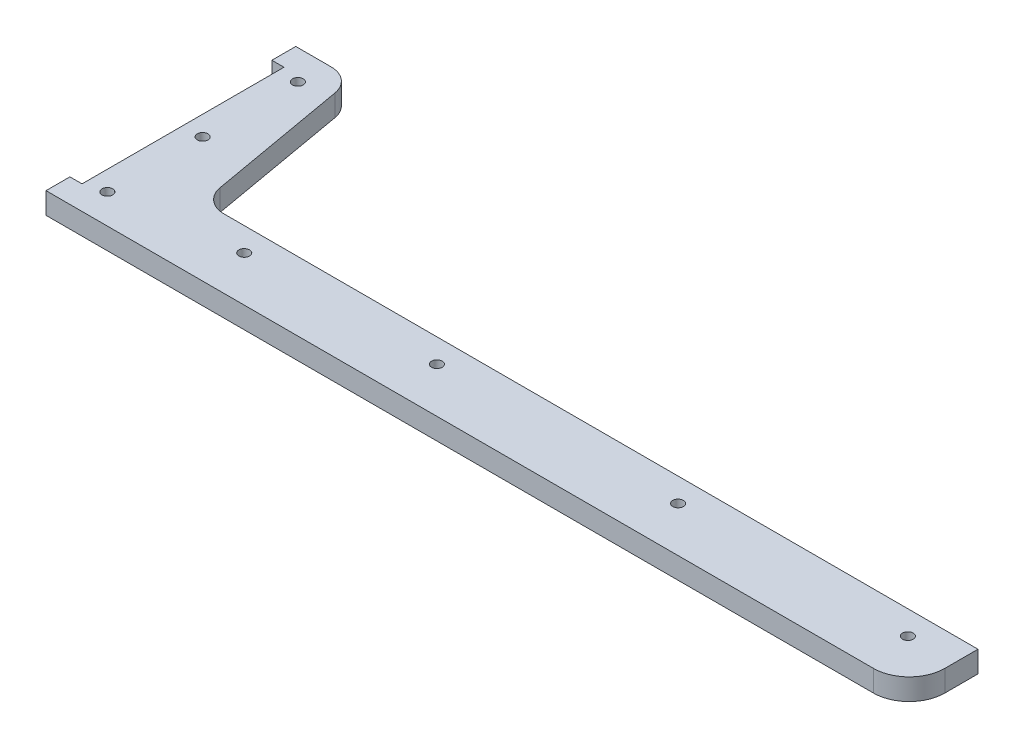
ISO-10303-21;
HEADER;
FILE_DESCRIPTION(('STEP AP214'),'2;1');
FILE_NAME('part.step','',(''),(''),'','','');
FILE_SCHEMA(('AUTOMOTIVE_DESIGN { 1 0 10303 214 1 1 1 1 }'));
ENDSEC;
DATA;
#1=APPLICATION_CONTEXT('core data for automotive mechanical design processes');
#2=APPLICATION_PROTOCOL_DEFINITION('international standard','automotive_design',2000,#1);
#3=PRODUCT_CONTEXT('',#1,'mechanical');
#4=PRODUCT('Part','Part','',(#3));
#5=PRODUCT_RELATED_PRODUCT_CATEGORY('part','',(#4));
#6=PRODUCT_DEFINITION_FORMATION('','',#4);
#7=PRODUCT_DEFINITION_CONTEXT('part definition',#1,'design');
#8=PRODUCT_DEFINITION('design','',#6,#7);
#9=PRODUCT_DEFINITION_SHAPE('','',#8);
#10=(LENGTH_UNIT() NAMED_UNIT(*) SI_UNIT(.MILLI.,.METRE.));
#11=(NAMED_UNIT(*) PLANE_ANGLE_UNIT() SI_UNIT($,.RADIAN.));
#12=(NAMED_UNIT(*) SI_UNIT($,.STERADIAN.) SOLID_ANGLE_UNIT());
#13=UNCERTAINTY_MEASURE_WITH_UNIT(LENGTH_MEASURE(1.E-05),#10,'distance_accuracy_value','');
#14=(GEOMETRIC_REPRESENTATION_CONTEXT(3) GLOBAL_UNCERTAINTY_ASSIGNED_CONTEXT((#13)) GLOBAL_UNIT_ASSIGNED_CONTEXT((#10,
#11,#12)) REPRESENTATION_CONTEXT('',''));
#15=CARTESIAN_POINT('',(0.,0.,0.));
#16=DIRECTION('',(0.,0.,1.));
#17=DIRECTION('',(1.,0.,0.));
#18=AXIS2_PLACEMENT_3D('',#15,#16,#17);
#19=CARTESIAN_POINT('',(0.,3.,0.));
#20=DIRECTION('',(0.,1.,0.));
#21=DIRECTION('',(0.,0.,1.));
#22=AXIS2_PLACEMENT_3D('',#19,#20,#21);
#23=PLANE('',#22);
#24=CARTESIAN_POINT('',(16.,3.,11.));
#25=DIRECTION('',(0.,1.,0.));
#26=DIRECTION('',(0.,0.,1.));
#27=AXIS2_PLACEMENT_3D('',#24,#25,#26);
#28=CIRCLE('',#27,1.5);
#29=CARTESIAN_POINT('',(16.,3.,12.5));
#30=VERTEX_POINT('',#29);
#31=EDGE_CURVE('E251',#30,#30,#28,.F.);
#32=ORIENTED_EDGE('',*,*,#31,.T.);
#33=EDGE_LOOP('',(#32));
#34=FACE_BOUND('',#33,.T.);
#35=CARTESIAN_POINT('',(16.,3.,-15.7));
#36=DIRECTION('',(0.,1.,0.));
#37=DIRECTION('',(0.,0.,1.));
#38=AXIS2_PLACEMENT_3D('',#35,#36,#37);
#39=CIRCLE('',#38,1.5);
#40=CARTESIAN_POINT('',(16.,3.,-14.2));
#41=VERTEX_POINT('',#40);
#42=EDGE_CURVE('E255',#41,#41,#39,.F.);
#43=ORIENTED_EDGE('',*,*,#42,.T.);
#44=EDGE_LOOP('',(#43));
#45=FACE_BOUND('',#44,.T.);
#46=CARTESIAN_POINT('',(16.,3.,-42.4));
#47=DIRECTION('',(0.,1.,0.));
#48=DIRECTION('',(0.,0.,1.));
#49=AXIS2_PLACEMENT_3D('',#46,#47,#48);
#50=CIRCLE('',#49,1.5);
#51=CARTESIAN_POINT('',(16.,3.,-40.9));
#52=VERTEX_POINT('',#51);
#53=EDGE_CURVE('E259',#52,#52,#50,.F.);
#54=ORIENTED_EDGE('',*,*,#53,.T.);
#55=EDGE_LOOP('',(#54));
#56=FACE_BOUND('',#55,.T.);
#57=CARTESIAN_POINT('',(50.,3.,6.65));
#58=DIRECTION('',(0.,1.,0.));
#59=DIRECTION('',(0.,0.,1.));
#60=AXIS2_PLACEMENT_3D('',#57,#58,#59);
#61=CIRCLE('',#60,1.5);
#62=CARTESIAN_POINT('',(50.,3.,8.15));
#63=VERTEX_POINT('',#62);
#64=EDGE_CURVE('E263',#63,#63,#61,.F.);
#65=ORIENTED_EDGE('',*,*,#64,.T.);
#66=EDGE_LOOP('',(#65));
#67=FACE_BOUND('',#66,.T.);
#68=CARTESIAN_POINT('',(104.,3.,6.65));
#69=DIRECTION('',(0.,1.,0.));
#70=DIRECTION('',(0.,0.,1.));
#71=AXIS2_PLACEMENT_3D('',#68,#69,#70);
#72=CIRCLE('',#71,1.5);
#73=CARTESIAN_POINT('',(104.,3.,8.15));
#74=VERTEX_POINT('',#73);
#75=EDGE_CURVE('E267',#74,#74,#72,.F.);
#76=ORIENTED_EDGE('',*,*,#75,.T.);
#77=EDGE_LOOP('',(#76));
#78=FACE_BOUND('',#77,.T.);
#79=CARTESIAN_POINT('',(171.6,3.,6.65));
#80=DIRECTION('',(0.,1.,0.));
#81=DIRECTION('',(0.,0.,1.));
#82=AXIS2_PLACEMENT_3D('',#79,#80,#81);
#83=CIRCLE('',#82,1.5);
#84=CARTESIAN_POINT('',(171.6,3.,8.15));
#85=VERTEX_POINT('',#84);
#86=EDGE_CURVE('E271',#85,#85,#83,.F.);
#87=ORIENTED_EDGE('',*,*,#86,.T.);
#88=EDGE_LOOP('',(#87));
#89=FACE_BOUND('',#88,.T.);
#90=CARTESIAN_POINT('',(236.,3.,6.65));
#91=DIRECTION('',(0.,1.,0.));
#92=DIRECTION('',(0.,0.,1.));
#93=AXIS2_PLACEMENT_3D('',#90,#91,#92);
#94=CIRCLE('',#93,1.5);
#95=CARTESIAN_POINT('',(236.,3.,8.15));
#96=VERTEX_POINT('',#95);
#97=EDGE_CURVE('E160',#96,#96,#94,.F.);
#98=ORIENTED_EDGE('',*,*,#97,.T.);
#99=EDGE_LOOP('',(#98));
#100=FACE_BOUND('',#99,.T.);
#101=DIRECTION('',(-1.,0.,0.));
#102=VECTOR('',#101,1.);
#103=CARTESIAN_POINT('',(249.,3.,0.));
#104=LINE('',#103,#102);
#105=CARTESIAN_POINT('',(37.67369741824,3.,0.));
#106=VERTEX_POINT('',#105);
#107=CARTESIAN_POINT('',(249.,3.,0.));
#108=VERTEX_POINT('',#107);
#109=EDGE_CURVE('E147',#106,#108,#104,.F.);
#110=ORIENTED_EDGE('',*,*,#109,.F.);
#111=CARTESIAN_POINT('',(37.67369741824,3.,-7.));
#112=DIRECTION('',(0.,1.,0.));
#113=DIRECTION('',(0.,0.,1.));
#114=AXIS2_PLACEMENT_3D('',#111,#112,#113);
#115=CIRCLE('',#114,7.);
#116=CARTESIAN_POINT('',(30.7800431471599,3.,-5.7844627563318));
#117=VERTEX_POINT('',#116);
#118=EDGE_CURVE('E20',#106,#117,#115,.F.);
#119=ORIENTED_EDGE('',*,*,#118,.T.);
#120=DIRECTION('',(-0.173648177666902,0.,-0.984807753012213));
#121=VECTOR('',#120,1.);
#122=CARTESIAN_POINT('',(30.78004314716,3.,-5.784462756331));
#123=LINE('',#122,#121);
#124=CARTESIAN_POINT('',(23.880178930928,3.,-44.9155372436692));
#125=VERTEX_POINT('',#124);
#126=EDGE_CURVE('E145',#125,#117,#123,.F.);
#127=ORIENTED_EDGE('',*,*,#126,.F.);
#128=CARTESIAN_POINT('',(16.98652465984,3.,-43.7));
#129=DIRECTION('',(0.,1.,0.));
#130=DIRECTION('',(0.,0.,1.));
#131=AXIS2_PLACEMENT_3D('',#128,#129,#130);
#132=CIRCLE('',#131,7.);
#133=CARTESIAN_POINT('',(16.98652465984,3.,-50.7));
#134=VERTEX_POINT('',#133);
#135=EDGE_CURVE('E281',#134,#125,#132,.F.);
#136=ORIENTED_EDGE('',*,*,#135,.F.);
#137=DIRECTION('',(-1.,0.,0.));
#138=VECTOR('',#137,1.);
#139=CARTESIAN_POINT('',(16.98652465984,3.,-50.7));
#140=LINE('',#139,#138);
#141=CARTESIAN_POINT('',(7.1,3.,-50.7));
#142=VERTEX_POINT('',#141);
#143=EDGE_CURVE('E205',#142,#134,#140,.F.);
#144=ORIENTED_EDGE('',*,*,#143,.F.);
#145=DIRECTION('',(0.,0.,1.));
#146=VECTOR('',#145,1.);
#147=CARTESIAN_POINT('',(7.1,3.,-50.7));
#148=LINE('',#147,#146);
#149=CARTESIAN_POINT('',(7.1,3.,-44.));
#150=VERTEX_POINT('',#149);
#151=EDGE_CURVE('E199',#150,#142,#148,.F.);
#152=ORIENTED_EDGE('',*,*,#151,.F.);
#153=DIRECTION('',(1.,0.,0.));
#154=VECTOR('',#153,1.);
#155=CARTESIAN_POINT('',(7.1,3.,-44.));
#156=LINE('',#155,#154);
#157=CARTESIAN_POINT('',(10.5,3.,-44.));
#158=VERTEX_POINT('',#157);
#159=EDGE_CURVE('E193',#158,#150,#156,.F.);
#160=ORIENTED_EDGE('',*,*,#159,.F.);
#161=DIRECTION('',(0.,0.,1.));
#162=VECTOR('',#161,1.);
#163=CARTESIAN_POINT('',(10.5,3.,-44.));
#164=LINE('',#163,#162);
#165=CARTESIAN_POINT('',(10.5,3.,12.6));
#166=VERTEX_POINT('',#165);
#167=EDGE_CURVE('E187',#166,#158,#164,.F.);
#168=ORIENTED_EDGE('',*,*,#167,.F.);
#169=DIRECTION('',(-1.,0.,0.));
#170=VECTOR('',#169,1.);
#171=CARTESIAN_POINT('',(10.5,3.,12.6));
#172=LINE('',#171,#170);
#173=CARTESIAN_POINT('',(7.1,3.,12.6));
#174=VERTEX_POINT('',#173);
#175=EDGE_CURVE('E181',#174,#166,#172,.F.);
#176=ORIENTED_EDGE('',*,*,#175,.F.);
#177=DIRECTION('',(0.,0.,1.));
#178=VECTOR('',#177,1.);
#179=CARTESIAN_POINT('',(7.1,3.,12.6));
#180=LINE('',#179,#178);
#181=CARTESIAN_POINT('',(7.1,3.,19.3));
#182=VERTEX_POINT('',#181);
#183=EDGE_CURVE('E175',#182,#174,#180,.F.);
#184=ORIENTED_EDGE('',*,*,#183,.F.);
#185=DIRECTION('',(1.,0.,0.));
#186=VECTOR('',#185,1.);
#187=CARTESIAN_POINT('',(7.1,3.,19.3));
#188=LINE('',#187,#186);
#189=CARTESIAN_POINT('',(239.,3.,19.3));
#190=VERTEX_POINT('',#189);
#191=EDGE_CURVE('E168',#190,#182,#188,.F.);
#192=ORIENTED_EDGE('',*,*,#191,.F.);
#193=CARTESIAN_POINT('',(239.,3.,9.3));
#194=DIRECTION('',(0.,1.,0.));
#195=DIRECTION('',(0.,0.,1.));
#196=AXIS2_PLACEMENT_3D('',#193,#194,#195);
#197=CIRCLE('',#196,10.);
#198=CARTESIAN_POINT('',(249.,3.,9.3));
#199=VERTEX_POINT('',#198);
#200=EDGE_CURVE('E278',#199,#190,#197,.F.);
#201=ORIENTED_EDGE('',*,*,#200,.F.);
#202=DIRECTION('',(0.,0.,-1.));
#203=VECTOR('',#202,1.);
#204=CARTESIAN_POINT('',(249.,3.,9.3));
#205=LINE('',#204,#203);
#206=EDGE_CURVE('E154',#108,#199,#205,.F.);
#207=ORIENTED_EDGE('',*,*,#206,.F.);
#208=EDGE_LOOP('',(#110,#119,#127,#136,#144,#152,#160,#168,#176,#184,#192,#201,#207));
#209=FACE_BOUND('',#208,.T.);
#210=ADVANCED_FACE('F17',(#34,#45,#56,#67,#78,#89,#100,#209),#23,.T.);
#211=CARTESIAN_POINT('',(37.67369741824,-3.,-7.));
#212=DIRECTION('',(0.,1.,0.));
#213=DIRECTION('',(0.,0.,1.));
#214=AXIS2_PLACEMENT_3D('',#211,#212,#213);
#215=CYLINDRICAL_SURFACE('',#214,7.);
#216=ORIENTED_EDGE('',*,*,#118,.F.);
#217=DIRECTION('',(0.,1.,0.));
#218=VECTOR('',#217,1.);
#219=CARTESIAN_POINT('',(37.67369741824,-3.,0.));
#220=LINE('',#219,#218);
#221=CARTESIAN_POINT('',(37.67369741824,-3.,0.));
#222=VERTEX_POINT('',#221);
#223=EDGE_CURVE('E139',#222,#106,#220,.T.);
#224=ORIENTED_EDGE('',*,*,#223,.F.);
#225=CARTESIAN_POINT('',(37.67369741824,-3.,-7.));
#226=DIRECTION('',(0.,1.,0.));
#227=DIRECTION('',(0.,0.,1.));
#228=AXIS2_PLACEMENT_3D('',#225,#226,#227);
#229=CIRCLE('',#228,7.);
#230=CARTESIAN_POINT('',(30.7800431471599,-3.,-5.78446275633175));
#231=VERTEX_POINT('',#230);
#232=EDGE_CURVE('E249',#222,#231,#229,.F.);
#233=ORIENTED_EDGE('',*,*,#232,.T.);
#234=DIRECTION('',(0.,1.,0.));
#235=VECTOR('',#234,1.);
#236=CARTESIAN_POINT('',(30.78004314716,-3.,-5.784462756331));
#237=LINE('',#236,#235);
#238=EDGE_CURVE('E140',#117,#231,#237,.F.);
#239=ORIENTED_EDGE('',*,*,#238,.F.);
#240=EDGE_LOOP('',(#216,#224,#233,#239));
#241=FACE_BOUND('',#240,.T.);
#242=ADVANCED_FACE('F137',(#241),#215,.F.);
#243=CARTESIAN_POINT('',(30.78004314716,-3.,-5.784462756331));
#244=DIRECTION('',(0.984807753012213,0.,-0.173648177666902));
#245=DIRECTION('',(-0.173648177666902,0.,-0.984807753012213));
#246=AXIS2_PLACEMENT_3D('',#243,#244,#245);
#247=PLANE('',#246);
#248=ORIENTED_EDGE('',*,*,#238,.T.);
#249=DIRECTION('',(-0.173648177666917,0.,-0.98480775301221));
#250=VECTOR('',#249,1.);
#251=CARTESIAN_POINT('',(30.78004314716,-3.,-5.784462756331));
#252=LINE('',#251,#250);
#253=CARTESIAN_POINT('',(23.8801789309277,-3.,-44.9155372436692));
#254=VERTEX_POINT('',#253);
#255=EDGE_CURVE('E248',#231,#254,#252,.T.);
#256=ORIENTED_EDGE('',*,*,#255,.T.);
#257=DIRECTION('',(0.,1.,0.));
#258=VECTOR('',#257,1.);
#259=CARTESIAN_POINT('',(23.8801789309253,-3.,-44.9155372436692));
#260=LINE('',#259,#258);
#261=EDGE_CURVE('E208',#125,#254,#260,.F.);
#262=ORIENTED_EDGE('',*,*,#261,.F.);
#263=ORIENTED_EDGE('',*,*,#126,.T.);
#264=EDGE_LOOP('',(#248,#256,#262,#263));
#265=FACE_BOUND('',#264,.T.);
#266=ADVANCED_FACE('F376',(#265),#247,.T.);
#267=CARTESIAN_POINT('',(16.98652465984,-3.,-43.7));
#268=DIRECTION('',(0.,1.,0.));
#269=DIRECTION('',(0.,0.,1.));
#270=AXIS2_PLACEMENT_3D('',#267,#268,#269);
#271=CYLINDRICAL_SURFACE('',#270,7.);
#272=ORIENTED_EDGE('',*,*,#261,.T.);
#273=CARTESIAN_POINT('',(16.98652465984,-3.,-43.7));
#274=DIRECTION('',(0.,1.,0.));
#275=DIRECTION('',(0.,0.,1.));
#276=AXIS2_PLACEMENT_3D('',#273,#274,#275);
#277=CIRCLE('',#276,7.);
#278=CARTESIAN_POINT('',(16.98652465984,-3.,-50.7));
#279=VERTEX_POINT('',#278);
#280=EDGE_CURVE('E243',#254,#279,#277,.T.);
#281=ORIENTED_EDGE('',*,*,#280,.T.);
#282=DIRECTION('',(0.,1.,0.));
#283=VECTOR('',#282,1.);
#284=CARTESIAN_POINT('',(16.98652465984,-3.,-50.7));
#285=LINE('',#284,#283);
#286=EDGE_CURVE('E202',#134,#279,#285,.F.);
#287=ORIENTED_EDGE('',*,*,#286,.F.);
#288=ORIENTED_EDGE('',*,*,#135,.T.);
#289=EDGE_LOOP('',(#272,#281,#287,#288));
#290=FACE_BOUND('',#289,.T.);
#291=ADVANCED_FACE('F374',(#290),#271,.T.);
#292=CARTESIAN_POINT('',(16.98652465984,-3.,-50.7));
#293=DIRECTION('',(0.,0.,-1.));
#294=DIRECTION('',(-1.,0.,0.));
#295=AXIS2_PLACEMENT_3D('',#292,#293,#294);
#296=PLANE('',#295);
#297=ORIENTED_EDGE('',*,*,#286,.T.);
#298=DIRECTION('',(1.,0.,0.));
#299=VECTOR('',#298,1.);
#300=CARTESIAN_POINT('',(0.,-3.,-50.7));
#301=LINE('',#300,#299);
#302=CARTESIAN_POINT('',(7.1,-3.,-50.7));
#303=VERTEX_POINT('',#302);
#304=EDGE_CURVE('E247',#279,#303,#301,.F.);
#305=ORIENTED_EDGE('',*,*,#304,.T.);
#306=DIRECTION('',(0.,1.,0.));
#307=VECTOR('',#306,1.);
#308=CARTESIAN_POINT('',(7.1,-3.,-50.7));
#309=LINE('',#308,#307);
#310=EDGE_CURVE('E196',#142,#303,#309,.F.);
#311=ORIENTED_EDGE('',*,*,#310,.F.);
#312=ORIENTED_EDGE('',*,*,#143,.T.);
#313=EDGE_LOOP('',(#297,#305,#311,#312));
#314=FACE_BOUND('',#313,.T.);
#315=ADVANCED_FACE('F363',(#314),#296,.T.);
#316=CARTESIAN_POINT('',(7.1,-3.,-50.7));
#317=DIRECTION('',(-1.,0.,0.));
#318=DIRECTION('',(0.,0.,1.));
#319=AXIS2_PLACEMENT_3D('',#316,#317,#318);
#320=PLANE('',#319);
#321=ORIENTED_EDGE('',*,*,#310,.T.);
#322=DIRECTION('',(0.,0.,1.));
#323=VECTOR('',#322,1.);
#324=CARTESIAN_POINT('',(7.1,-3.,0.));
#325=LINE('',#324,#323);
#326=CARTESIAN_POINT('',(7.1,-3.,-44.));
#327=VERTEX_POINT('',#326);
#328=EDGE_CURVE('E344',#303,#327,#325,.T.);
#329=ORIENTED_EDGE('',*,*,#328,.T.);
#330=DIRECTION('',(0.,1.,0.));
#331=VECTOR('',#330,1.);
#332=CARTESIAN_POINT('',(7.1,-3.,-44.));
#333=LINE('',#332,#331);
#334=EDGE_CURVE('E190',#150,#327,#333,.F.);
#335=ORIENTED_EDGE('',*,*,#334,.F.);
#336=ORIENTED_EDGE('',*,*,#151,.T.);
#337=EDGE_LOOP('',(#321,#329,#335,#336));
#338=FACE_BOUND('',#337,.T.);
#339=ADVANCED_FACE('F426',(#338),#320,.T.);
#340=CARTESIAN_POINT('',(7.1,-3.,-44.));
#341=DIRECTION('',(0.,0.,1.));
#342=DIRECTION('',(1.,0.,0.));
#343=AXIS2_PLACEMENT_3D('',#340,#341,#342);
#344=PLANE('',#343);
#345=ORIENTED_EDGE('',*,*,#334,.T.);
#346=DIRECTION('',(1.,0.,0.));
#347=VECTOR('',#346,1.);
#348=CARTESIAN_POINT('',(0.,-3.,-44.));
#349=LINE('',#348,#347);
#350=CARTESIAN_POINT('',(10.5,-3.,-44.));
#351=VERTEX_POINT('',#350);
#352=EDGE_CURVE('E335',#327,#351,#349,.T.);
#353=ORIENTED_EDGE('',*,*,#352,.T.);
#354=DIRECTION('',(0.,1.,0.));
#355=VECTOR('',#354,1.);
#356=CARTESIAN_POINT('',(10.5,-3.,-44.));
#357=LINE('',#356,#355);
#358=EDGE_CURVE('E184',#158,#351,#357,.F.);
#359=ORIENTED_EDGE('',*,*,#358,.F.);
#360=ORIENTED_EDGE('',*,*,#159,.T.);
#361=EDGE_LOOP('',(#345,#353,#359,#360));
#362=FACE_BOUND('',#361,.T.);
#363=ADVANCED_FACE('F422',(#362),#344,.T.);
#364=CARTESIAN_POINT('',(10.5,-3.,-44.));
#365=DIRECTION('',(-1.,0.,0.));
#366=DIRECTION('',(0.,0.,1.));
#367=AXIS2_PLACEMENT_3D('',#364,#365,#366);
#368=PLANE('',#367);
#369=ORIENTED_EDGE('',*,*,#358,.T.);
#370=DIRECTION('',(0.,0.,1.));
#371=VECTOR('',#370,1.);
#372=CARTESIAN_POINT('',(10.5,-3.,0.));
#373=LINE('',#372,#371);
#374=CARTESIAN_POINT('',(10.5,-3.,12.6));
#375=VERTEX_POINT('',#374);
#376=EDGE_CURVE('E325',#351,#375,#373,.T.);
#377=ORIENTED_EDGE('',*,*,#376,.T.);
#378=DIRECTION('',(0.,1.,0.));
#379=VECTOR('',#378,1.);
#380=CARTESIAN_POINT('',(10.5,-3.,12.6));
#381=LINE('',#380,#379);
#382=EDGE_CURVE('E178',#166,#375,#381,.F.);
#383=ORIENTED_EDGE('',*,*,#382,.F.);
#384=ORIENTED_EDGE('',*,*,#167,.T.);
#385=EDGE_LOOP('',(#369,#377,#383,#384));
#386=FACE_BOUND('',#385,.T.);
#387=ADVANCED_FACE('F418',(#386),#368,.T.);
#388=CARTESIAN_POINT('',(10.5,-3.,12.6));
#389=DIRECTION('',(0.,0.,-1.));
#390=DIRECTION('',(-1.,0.,0.));
#391=AXIS2_PLACEMENT_3D('',#388,#389,#390);
#392=PLANE('',#391);
#393=ORIENTED_EDGE('',*,*,#382,.T.);
#394=DIRECTION('',(1.,0.,0.));
#395=VECTOR('',#394,1.);
#396=CARTESIAN_POINT('',(0.,-3.,12.6));
#397=LINE('',#396,#395);
#398=CARTESIAN_POINT('',(7.1,-3.,12.6));
#399=VERTEX_POINT('',#398);
#400=EDGE_CURVE('E315',#375,#399,#397,.F.);
#401=ORIENTED_EDGE('',*,*,#400,.T.);
#402=DIRECTION('',(0.,1.,0.));
#403=VECTOR('',#402,1.);
#404=CARTESIAN_POINT('',(7.1,-3.,12.6));
#405=LINE('',#404,#403);
#406=EDGE_CURVE('E172',#174,#399,#405,.F.);
#407=ORIENTED_EDGE('',*,*,#406,.F.);
#408=ORIENTED_EDGE('',*,*,#175,.T.);
#409=EDGE_LOOP('',(#393,#401,#407,#408));
#410=FACE_BOUND('',#409,.T.);
#411=ADVANCED_FACE('F413',(#410),#392,.T.);
#412=CARTESIAN_POINT('',(7.1,-3.,12.6));
#413=DIRECTION('',(-1.,0.,0.));
#414=DIRECTION('',(0.,0.,1.));
#415=AXIS2_PLACEMENT_3D('',#412,#413,#414);
#416=PLANE('',#415);
#417=ORIENTED_EDGE('',*,*,#406,.T.);
#418=DIRECTION('',(0.,0.,1.));
#419=VECTOR('',#418,1.);
#420=CARTESIAN_POINT('',(7.1,-3.,0.));
#421=LINE('',#420,#419);
#422=CARTESIAN_POINT('',(7.1,-3.,19.3));
#423=VERTEX_POINT('',#422);
#424=EDGE_CURVE('E311',#399,#423,#421,.T.);
#425=ORIENTED_EDGE('',*,*,#424,.T.);
#426=DIRECTION('',(0.,1.,0.));
#427=VECTOR('',#426,1.);
#428=CARTESIAN_POINT('',(7.1,-3.,19.3));
#429=LINE('',#428,#427);
#430=EDGE_CURVE('E171',#182,#423,#429,.F.);
#431=ORIENTED_EDGE('',*,*,#430,.F.);
#432=ORIENTED_EDGE('',*,*,#183,.T.);
#433=EDGE_LOOP('',(#417,#425,#431,#432));
#434=FACE_BOUND('',#433,.T.);
#435=ADVANCED_FACE('F410',(#434),#416,.T.);
#436=CARTESIAN_POINT('',(7.1,-3.,19.3));
#437=DIRECTION('',(0.,0.,1.));
#438=DIRECTION('',(1.,0.,0.));
#439=AXIS2_PLACEMENT_3D('',#436,#437,#438);
#440=PLANE('',#439);
#441=ORIENTED_EDGE('',*,*,#430,.T.);
#442=DIRECTION('',(1.,0.,0.));
#443=VECTOR('',#442,1.);
#444=CARTESIAN_POINT('',(0.,-3.,19.3));
#445=LINE('',#444,#443);
#446=CARTESIAN_POINT('',(239.,-3.,19.3));
#447=VERTEX_POINT('',#446);
#448=EDGE_CURVE('E242',#423,#447,#445,.T.);
#449=ORIENTED_EDGE('',*,*,#448,.T.);
#450=DIRECTION('',(0.,1.,0.));
#451=VECTOR('',#450,1.);
#452=CARTESIAN_POINT('',(239.,-3.,19.3));
#453=LINE('',#452,#451);
#454=EDGE_CURVE('E280',#190,#447,#453,.F.);
#455=ORIENTED_EDGE('',*,*,#454,.F.);
#456=ORIENTED_EDGE('',*,*,#191,.T.);
#457=EDGE_LOOP('',(#441,#449,#455,#456));
#458=FACE_BOUND('',#457,.T.);
#459=ADVANCED_FACE('F406',(#458),#440,.T.);
#460=CARTESIAN_POINT('',(239.,-3.,9.3));
#461=DIRECTION('',(0.,1.,0.));
#462=DIRECTION('',(0.,0.,1.));
#463=AXIS2_PLACEMENT_3D('',#460,#461,#462);
#464=CYLINDRICAL_SURFACE('',#463,10.);
#465=ORIENTED_EDGE('',*,*,#454,.T.);
#466=CARTESIAN_POINT('',(239.,-3.,9.3));
#467=DIRECTION('',(0.,1.,0.));
#468=DIRECTION('',(0.,0.,1.));
#469=AXIS2_PLACEMENT_3D('',#466,#467,#468);
#470=CIRCLE('',#469,10.);
#471=CARTESIAN_POINT('',(249.,-3.,9.3));
#472=VERTEX_POINT('',#471);
#473=EDGE_CURVE('E237',#447,#472,#470,.T.);
#474=ORIENTED_EDGE('',*,*,#473,.T.);
#475=DIRECTION('',(0.,1.,0.));
#476=VECTOR('',#475,1.);
#477=CARTESIAN_POINT('',(249.,-3.,9.3));
#478=LINE('',#477,#476);
#479=EDGE_CURVE('E151',#199,#472,#478,.F.);
#480=ORIENTED_EDGE('',*,*,#479,.F.);
#481=ORIENTED_EDGE('',*,*,#200,.T.);
#482=EDGE_LOOP('',(#465,#474,#480,#481));
#483=FACE_BOUND('',#482,.T.);
#484=ADVANCED_FACE('F400',(#483),#464,.T.);
#485=CARTESIAN_POINT('',(249.,-3.,9.3));
#486=DIRECTION('',(1.,0.,0.));
#487=DIRECTION('',(0.,0.,-1.));
#488=AXIS2_PLACEMENT_3D('',#485,#486,#487);
#489=PLANE('',#488);
#490=ORIENTED_EDGE('',*,*,#479,.T.);
#491=DIRECTION('',(0.,0.,1.));
#492=VECTOR('',#491,1.);
#493=CARTESIAN_POINT('',(249.,-3.,0.));
#494=LINE('',#493,#492);
#495=CARTESIAN_POINT('',(249.,-3.,0.));
#496=VERTEX_POINT('',#495);
#497=EDGE_CURVE('E241',#472,#496,#494,.F.);
#498=ORIENTED_EDGE('',*,*,#497,.T.);
#499=DIRECTION('',(0.,1.,0.));
#500=VECTOR('',#499,1.);
#501=CARTESIAN_POINT('',(249.,-3.,0.));
#502=LINE('',#501,#500);
#503=EDGE_CURVE('E40',#108,#496,#502,.F.);
#504=ORIENTED_EDGE('',*,*,#503,.F.);
#505=ORIENTED_EDGE('',*,*,#206,.T.);
#506=EDGE_LOOP('',(#490,#498,#504,#505));
#507=FACE_BOUND('',#506,.T.);
#508=ADVANCED_FACE('F397',(#507),#489,.T.);
#509=CARTESIAN_POINT('',(249.,-3.,0.));
#510=DIRECTION('',(0.,0.,-1.));
#511=DIRECTION('',(-1.,0.,0.));
#512=AXIS2_PLACEMENT_3D('',#509,#510,#511);
#513=PLANE('',#512);
#514=ORIENTED_EDGE('',*,*,#503,.T.);
#515=DIRECTION('',(1.,0.,0.));
#516=VECTOR('',#515,1.);
#517=CARTESIAN_POINT('',(0.,-3.,0.));
#518=LINE('',#517,#516);
#519=EDGE_CURVE('E149',#496,#222,#518,.F.);
#520=ORIENTED_EDGE('',*,*,#519,.T.);
#521=ORIENTED_EDGE('',*,*,#223,.T.);
#522=ORIENTED_EDGE('',*,*,#109,.T.);
#523=EDGE_LOOP('',(#514,#520,#521,#522));
#524=FACE_BOUND('',#523,.T.);
#525=ADVANCED_FACE('F146',(#524),#513,.T.);
#526=CARTESIAN_POINT('',(236.,-3.,6.65));
#527=DIRECTION('',(0.,1.,0.));
#528=DIRECTION('',(0.,0.,1.));
#529=AXIS2_PLACEMENT_3D('',#526,#527,#528);
#530=CYLINDRICAL_SURFACE('',#529,1.5);
#531=ORIENTED_EDGE('',*,*,#97,.F.);
#532=EDGE_LOOP('',(#531));
#533=FACE_BOUND('',#532,.T.);
#534=CARTESIAN_POINT('',(236.,-3.,6.65));
#535=DIRECTION('',(0.,1.,0.));
#536=DIRECTION('',(0.,0.,1.));
#537=AXIS2_PLACEMENT_3D('',#534,#535,#536);
#538=CIRCLE('',#537,1.5);
#539=CARTESIAN_POINT('',(236.,-3.,8.15));
#540=VERTEX_POINT('',#539);
#541=EDGE_CURVE('E233',#540,#540,#538,.F.);
#542=ORIENTED_EDGE('',*,*,#541,.T.);
#543=EDGE_LOOP('',(#542));
#544=FACE_BOUND('',#543,.T.);
#545=ADVANCED_FACE('F468',(#533,#544),#530,.F.);
#546=CARTESIAN_POINT('',(171.6,-3.,6.65));
#547=DIRECTION('',(0.,1.,0.));
#548=DIRECTION('',(0.,0.,1.));
#549=AXIS2_PLACEMENT_3D('',#546,#547,#548);
#550=CYLINDRICAL_SURFACE('',#549,1.5);
#551=ORIENTED_EDGE('',*,*,#86,.F.);
#552=EDGE_LOOP('',(#551));
#553=FACE_BOUND('',#552,.T.);
#554=CARTESIAN_POINT('',(171.6,-3.,6.65));
#555=DIRECTION('',(0.,1.,0.));
#556=DIRECTION('',(0.,0.,1.));
#557=AXIS2_PLACEMENT_3D('',#554,#555,#556);
#558=CIRCLE('',#557,1.5);
#559=CARTESIAN_POINT('',(171.6,-3.,8.15));
#560=VERTEX_POINT('',#559);
#561=EDGE_CURVE('E229',#560,#560,#558,.F.);
#562=ORIENTED_EDGE('',*,*,#561,.T.);
#563=EDGE_LOOP('',(#562));
#564=FACE_BOUND('',#563,.T.);
#565=ADVANCED_FACE('F464',(#553,#564),#550,.F.);
#566=CARTESIAN_POINT('',(104.,-3.,6.65));
#567=DIRECTION('',(0.,1.,0.));
#568=DIRECTION('',(0.,0.,1.));
#569=AXIS2_PLACEMENT_3D('',#566,#567,#568);
#570=CYLINDRICAL_SURFACE('',#569,1.5);
#571=ORIENTED_EDGE('',*,*,#75,.F.);
#572=EDGE_LOOP('',(#571));
#573=FACE_BOUND('',#572,.T.);
#574=CARTESIAN_POINT('',(104.,-3.,6.65));
#575=DIRECTION('',(0.,1.,0.));
#576=DIRECTION('',(0.,0.,1.));
#577=AXIS2_PLACEMENT_3D('',#574,#575,#576);
#578=CIRCLE('',#577,1.5);
#579=CARTESIAN_POINT('',(104.,-3.,8.15));
#580=VERTEX_POINT('',#579);
#581=EDGE_CURVE('E225',#580,#580,#578,.F.);
#582=ORIENTED_EDGE('',*,*,#581,.T.);
#583=EDGE_LOOP('',(#582));
#584=FACE_BOUND('',#583,.T.);
#585=ADVANCED_FACE('F460',(#573,#584),#570,.F.);
#586=CARTESIAN_POINT('',(50.,-3.,6.65));
#587=DIRECTION('',(0.,1.,0.));
#588=DIRECTION('',(0.,0.,1.));
#589=AXIS2_PLACEMENT_3D('',#586,#587,#588);
#590=CYLINDRICAL_SURFACE('',#589,1.5);
#591=ORIENTED_EDGE('',*,*,#64,.F.);
#592=EDGE_LOOP('',(#591));
#593=FACE_BOUND('',#592,.T.);
#594=CARTESIAN_POINT('',(50.,-3.,6.65));
#595=DIRECTION('',(0.,1.,0.));
#596=DIRECTION('',(0.,0.,1.));
#597=AXIS2_PLACEMENT_3D('',#594,#595,#596);
#598=CIRCLE('',#597,1.5);
#599=CARTESIAN_POINT('',(50.,-3.,8.15));
#600=VERTEX_POINT('',#599);
#601=EDGE_CURVE('E221',#600,#600,#598,.F.);
#602=ORIENTED_EDGE('',*,*,#601,.T.);
#603=EDGE_LOOP('',(#602));
#604=FACE_BOUND('',#603,.T.);
#605=ADVANCED_FACE('F456',(#593,#604),#590,.F.);
#606=CARTESIAN_POINT('',(16.,-3.,-42.4));
#607=DIRECTION('',(0.,1.,0.));
#608=DIRECTION('',(0.,0.,1.));
#609=AXIS2_PLACEMENT_3D('',#606,#607,#608);
#610=CYLINDRICAL_SURFACE('',#609,1.5);
#611=ORIENTED_EDGE('',*,*,#53,.F.);
#612=EDGE_LOOP('',(#611));
#613=FACE_BOUND('',#612,.T.);
#614=CARTESIAN_POINT('',(16.,-3.,-42.4));
#615=DIRECTION('',(0.,1.,0.));
#616=DIRECTION('',(0.,0.,1.));
#617=AXIS2_PLACEMENT_3D('',#614,#615,#616);
#618=CIRCLE('',#617,1.5);
#619=CARTESIAN_POINT('',(16.,-3.,-40.9));
#620=VERTEX_POINT('',#619);
#621=EDGE_CURVE('E217',#620,#620,#618,.F.);
#622=ORIENTED_EDGE('',*,*,#621,.T.);
#623=EDGE_LOOP('',(#622));
#624=FACE_BOUND('',#623,.T.);
#625=ADVANCED_FACE('F452',(#613,#624),#610,.F.);
#626=CARTESIAN_POINT('',(16.,-3.,-15.7));
#627=DIRECTION('',(0.,1.,0.));
#628=DIRECTION('',(0.,0.,1.));
#629=AXIS2_PLACEMENT_3D('',#626,#627,#628);
#630=CYLINDRICAL_SURFACE('',#629,1.5);
#631=ORIENTED_EDGE('',*,*,#42,.F.);
#632=EDGE_LOOP('',(#631));
#633=FACE_BOUND('',#632,.T.);
#634=CARTESIAN_POINT('',(16.,-3.,-15.7));
#635=DIRECTION('',(0.,1.,0.));
#636=DIRECTION('',(0.,0.,1.));
#637=AXIS2_PLACEMENT_3D('',#634,#635,#636);
#638=CIRCLE('',#637,1.5);
#639=CARTESIAN_POINT('',(16.,-3.,-14.2));
#640=VERTEX_POINT('',#639);
#641=EDGE_CURVE('E27',#640,#640,#638,.F.);
#642=ORIENTED_EDGE('',*,*,#641,.T.);
#643=EDGE_LOOP('',(#642));
#644=FACE_BOUND('',#643,.T.);
#645=ADVANCED_FACE('F444',(#633,#644),#630,.F.);
#646=CARTESIAN_POINT('',(16.,-3.,11.));
#647=DIRECTION('',(0.,1.,0.));
#648=DIRECTION('',(0.,0.,1.));
#649=AXIS2_PLACEMENT_3D('',#646,#647,#648);
#650=CYLINDRICAL_SURFACE('',#649,1.5);
#651=ORIENTED_EDGE('',*,*,#31,.F.);
#652=EDGE_LOOP('',(#651));
#653=FACE_BOUND('',#652,.T.);
#654=CARTESIAN_POINT('',(16.,-3.,11.));
#655=DIRECTION('',(0.,1.,0.));
#656=DIRECTION('',(0.,0.,1.));
#657=AXIS2_PLACEMENT_3D('',#654,#655,#656);
#658=CIRCLE('',#657,1.5);
#659=CARTESIAN_POINT('',(16.,-3.,12.5));
#660=VERTEX_POINT('',#659);
#661=EDGE_CURVE('E11',#660,#660,#658,.F.);
#662=ORIENTED_EDGE('',*,*,#661,.T.);
#663=EDGE_LOOP('',(#662));
#664=FACE_BOUND('',#663,.T.);
#665=ADVANCED_FACE('F437',(#653,#664),#650,.F.);
#666=CARTESIAN_POINT('',(0.,-3.,0.));
#667=DIRECTION('',(0.,1.,0.));
#668=DIRECTION('',(0.,0.,1.));
#669=AXIS2_PLACEMENT_3D('',#666,#667,#668);
#670=PLANE('',#669);
#671=ORIENTED_EDGE('',*,*,#661,.F.);
#672=EDGE_LOOP('',(#671));
#673=FACE_BOUND('',#672,.T.);
#674=ORIENTED_EDGE('',*,*,#641,.F.);
#675=EDGE_LOOP('',(#674));
#676=FACE_BOUND('',#675,.T.);
#677=ORIENTED_EDGE('',*,*,#621,.F.);
#678=EDGE_LOOP('',(#677));
#679=FACE_BOUND('',#678,.T.);
#680=ORIENTED_EDGE('',*,*,#601,.F.);
#681=EDGE_LOOP('',(#680));
#682=FACE_BOUND('',#681,.T.);
#683=ORIENTED_EDGE('',*,*,#581,.F.);
#684=EDGE_LOOP('',(#683));
#685=FACE_BOUND('',#684,.T.);
#686=ORIENTED_EDGE('',*,*,#561,.F.);
#687=EDGE_LOOP('',(#686));
#688=FACE_BOUND('',#687,.T.);
#689=ORIENTED_EDGE('',*,*,#541,.F.);
#690=EDGE_LOOP('',(#689));
#691=FACE_BOUND('',#690,.T.);
#692=ORIENTED_EDGE('',*,*,#497,.F.);
#693=ORIENTED_EDGE('',*,*,#473,.F.);
#694=ORIENTED_EDGE('',*,*,#448,.F.);
#695=ORIENTED_EDGE('',*,*,#424,.F.);
#696=ORIENTED_EDGE('',*,*,#400,.F.);
#697=ORIENTED_EDGE('',*,*,#376,.F.);
#698=ORIENTED_EDGE('',*,*,#352,.F.);
#699=ORIENTED_EDGE('',*,*,#328,.F.);
#700=ORIENTED_EDGE('',*,*,#304,.F.);
#701=ORIENTED_EDGE('',*,*,#280,.F.);
#702=ORIENTED_EDGE('',*,*,#255,.F.);
#703=ORIENTED_EDGE('',*,*,#232,.F.);
#704=ORIENTED_EDGE('',*,*,#519,.F.);
#705=EDGE_LOOP('',(#692,#693,#694,#695,#696,#697,#698,#699,#700,#701,#702,#703,#704));
#706=FACE_BOUND('',#705,.T.);
#707=ADVANCED_FACE('F370',(#673,#676,#679,#682,#685,#688,#691,#706),#670,.F.);
#708=CLOSED_SHELL('',(#210,#242,#266,#291,#315,#339,#363,#387,#411,#435,#459,#484,#508,#525,
#545,#565,#585,#605,#625,#645,#665,#707));
#709=MANIFOLD_SOLID_BREP('B1',#708);
#710=ADVANCED_BREP_SHAPE_REPRESENTATION('',(#18,#709),#14);
#711=SHAPE_DEFINITION_REPRESENTATION(#9,#710);
ENDSEC;
END-ISO-10303-21;
